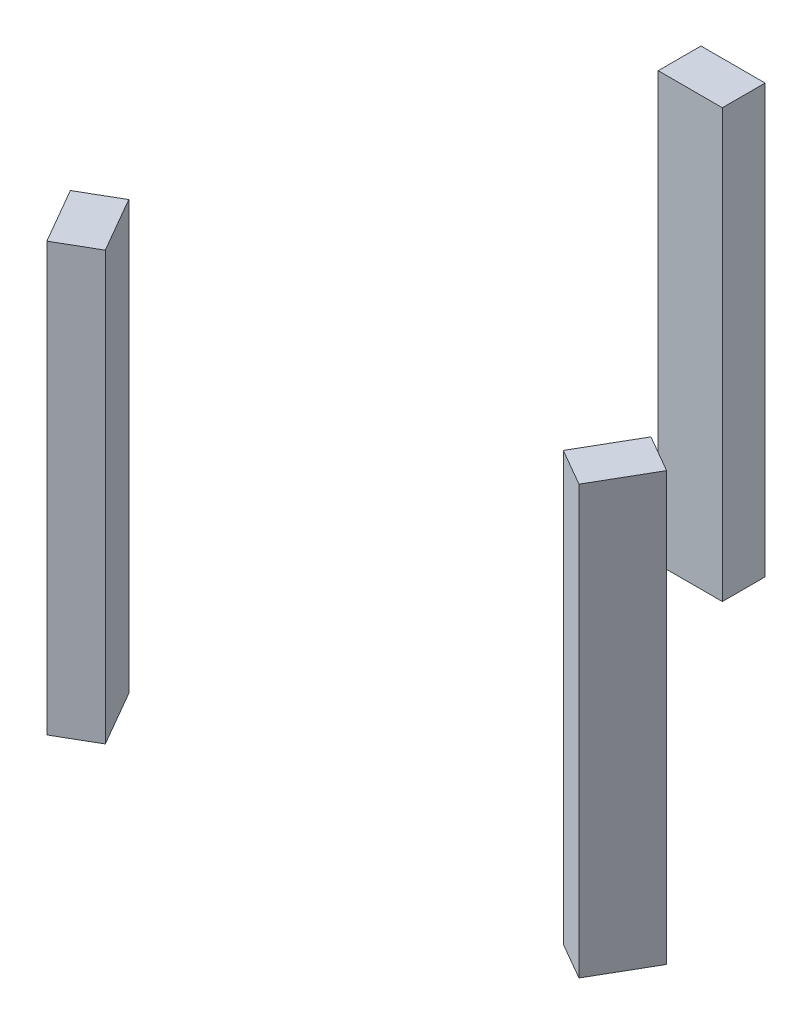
from build123d import *

# Parameters (mm, degrees)
SALIENTE_EXTRUIR1_DEPTH   = 200
CROQUIS1_W                = 30
CROQUIS1_H                = 20
SALIENTE_EXTRUIR1_2_DEPTH = 200
SALIENTE_EXTRUIR1_3_DEPTH = 200


with BuildPart() as part:
    # Croquis1 → Saliente-Extruir1 (new body)
    with BuildSketch(Plane.XZ):
        Polygon((-118.923048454, 68.660254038), (-103.923048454, 94.641016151), (-86.602540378, 84.641016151), (-101.602540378, 58.660254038), align=None)
    extrude(amount=-SALIENTE_EXTRUIR1_DEPTH)


with BuildPart() as body_2:
    # Croquis1 → Saliente-Extruir1 2 (new body)
    with BuildSketch(Plane.XZ):
        with Locations((-15, -127.320508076)):
            Rectangle(CROQUIS1_W, CROQUIS1_H)
    extrude(amount=-SALIENTE_EXTRUIR1_2_DEPTH)


with BuildPart() as body_3:
    # Croquis1 → Saliente-Extruir1 3 (new body)
    with BuildSketch(Plane.XZ):
        Polygon((118.923048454, 68.660254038), (133.923048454, 42.679491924), (116.602540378, 32.679491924), (101.602540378, 58.660254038), align=None)
    extrude(amount=-SALIENTE_EXTRUIR1_3_DEPTH)


solid = Compound([part.part, body_2.part, body_3.part])
